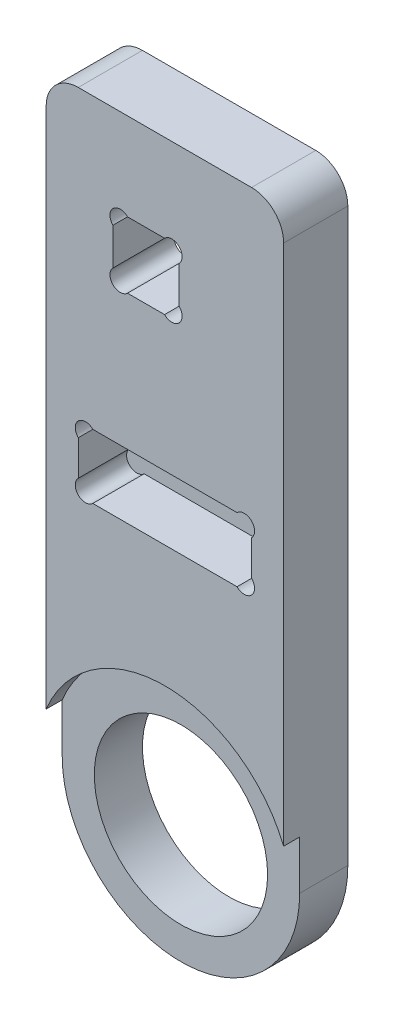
from build123d import *

# Parameters (mm, degrees)
ESQUISSE6_R              = 18.5
BOSS_EXTRU_2_DEPTH       = 10
ESQUISSE7_W              = 37
ESQUISSE7_H              = 94.98
BOSS_EXTRU_3_DEPTH       = 10
ESQUISSE8_R              = 13.5
ENL_V_MAT_EXTRU_10_DEPTH = 98.280267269
ENL_V_MAT_EXTRU_11_DEPTH = 8
ESQUISSE11_R             = 20
ENL_V_MAT_EXTRU_12_DEPTH = 2.5
ENL_V_MAT_EXTRU_13_DEPTH = 98.280267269
ESQUISSE13_W             = 37
ESQUISSE13_H             = 1
ENL_V_MAT_EXTRU_14_DEPTH = 98.280267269
CONG_1_R                 = 5


with BuildPart() as part:
    # Esquisse6 → Boss.-Extru.2 (new body)
    with BuildSketch(Plane.XY):
        Circle(ESQUISSE6_R)
    extrude(amount=BOSS_EXTRU_2_DEPTH)

    # Esquisse7 → Boss.-Extru.3 (add)
    with BuildSketch(Plane.XY.offset(10)):
        with Locations((0, 47.49)):
            Rectangle(ESQUISSE7_W, ESQUISSE7_H)
    extrude(amount=-BOSS_EXTRU_3_DEPTH)

    # Esquisse8 → Enl_v. mat.-Extru.10 (cut, through all)
    with BuildSketch(Plane.XY.offset(10)):
        Circle(ESQUISSE8_R)
    extrude(amount=-ENL_V_MAT_EXTRU_10_DEPTH, mode=Mode.SUBTRACT)

    # Esquisse9 → Enl_v. mat.-Extru.11 (cut)
    with BuildSketch(Plane.XY.offset(10)):
        with BuildLine():
            Line((-11.2372583, 48.98), (11.2372583, 48.98))
            ThreePointArc((11.2372583, 48.98), (13.5, 48.98), (13.5, 46.7172583))
            Line((13.5, 46.7172583), (13.5, 41.2427417))
            ThreePointArc((13.5, 41.2427417), (13.5, 38.98), (11.2372583, 38.98))
            Line((11.2372583, 38.98), (-11.2372583, 38.98))
            ThreePointArc((-11.2372583, 38.98), (-13.5, 38.98), (-13.5, 41.2427417))
            Line((-13.5, 41.2427417), (-13.5, 46.7172583))
            ThreePointArc((-13.5, 46.7172583), (-13.5, 48.98), (-11.2372583, 48.98))
        make_face()
    extrude(amount=-ENL_V_MAT_EXTRU_11_DEPTH, mode=Mode.SUBTRACT)

    # Esquisse11 → Enl_v. mat.-Extru.12 (cut)
    with BuildSketch(Plane.XY.offset(10)):
        Circle(ESQUISSE11_R)
    extrude(amount=-ENL_V_MAT_EXTRU_12_DEPTH, mode=Mode.SUBTRACT)

    # Esquisse12 → Enl_v. mat.-Extru.13 (cut, through all)
    with BuildSketch(Plane.XY.offset(10)):
        with BuildLine():
            Line((-5.8300672, 80.35385476), (-0.0555506, 80.35385476))
            ThreePointArc((-0.0555506, 80.35385476), (2.2071911, 80.35385476), (2.2071911, 78.09111306))
            Line((2.2071911, 78.09111306), (2.2071911, 72.31659646))
            ThreePointArc((2.2071911, 72.31659646), (2.2071911, 70.05385476), (-0.0555506, 70.05385476))
            Line((-0.0555506, 70.05385476), (-5.8300672, 70.05385476))
            ThreePointArc((-5.8300672, 70.05385476), (-8.0928089, 70.05385476), (-8.0928089, 72.31659646))
            Line((-8.0928089, 72.31659646), (-8.0928089, 78.09111306))
            ThreePointArc((-8.0928089, 78.09111306), (-8.0928089, 80.35385476), (-5.8300672, 80.35385476))
        make_face()
    extrude(amount=-ENL_V_MAT_EXTRU_13_DEPTH, mode=Mode.SUBTRACT)

    # Esquisse13 → Enl_v. mat.-Extru.14 (cut, through all)
    with BuildSketch(Plane.XY.offset(10)):
        with Locations((0, 94.48)):
            Rectangle(ESQUISSE13_W, ESQUISSE13_H)
    extrude(amount=-ENL_V_MAT_EXTRU_14_DEPTH, mode=Mode.SUBTRACT)

    # Cong_1
    cong_1_edges = [part.edges().sort_by_distance(p)[0] for p in [
        (-18.5, 93.98, 5),
        (18.5, 93.98, 5),
    ]]
    fillet(cong_1_edges, radius=CONG_1_R)


solid = part.part
